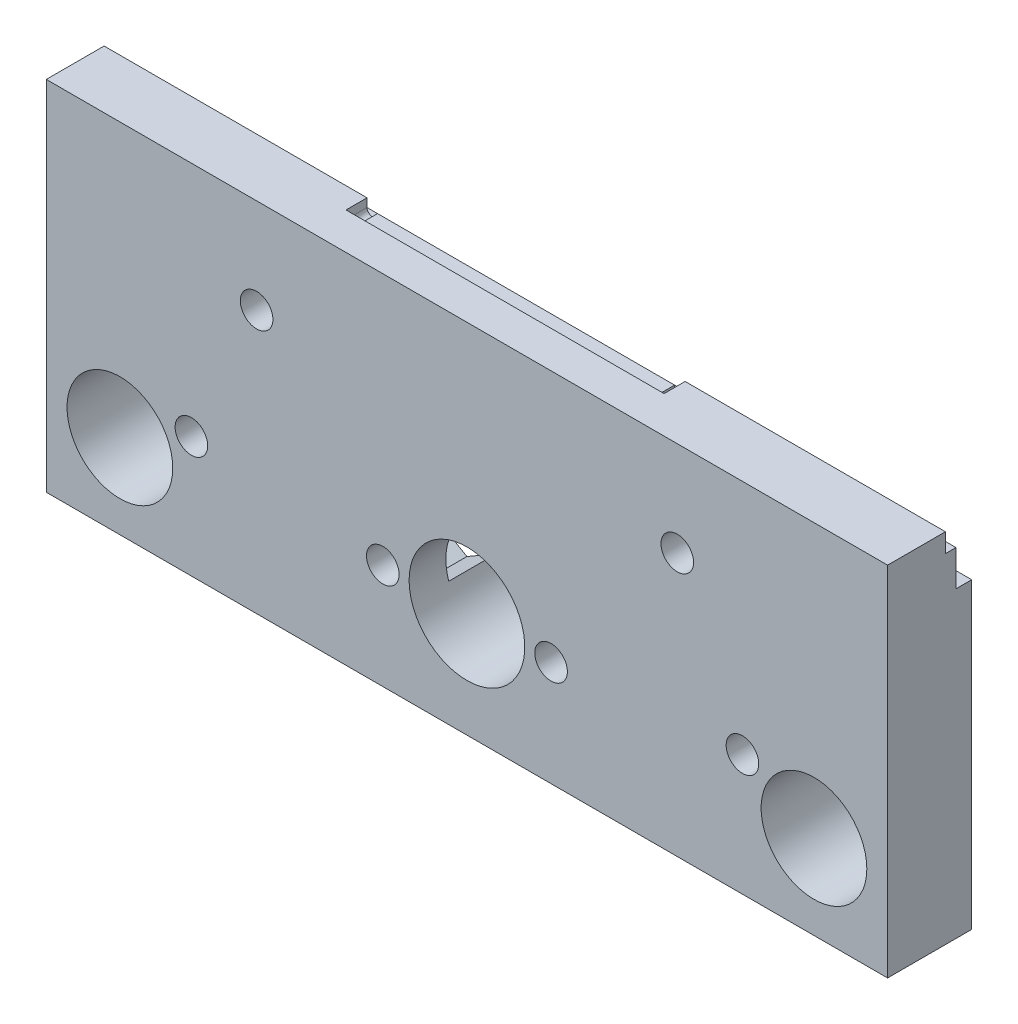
from build123d import *

# Parameters (mm, degrees)
SKETCH_2_W           = 80
SKETCH_2_H           = 34
SKETCH_2_R           = 5.025
SKETCH_2_R_2         = 4.05
EXTRUDE_1_DEPTH      = 8
CUT_EXTRUDE_2_DEPTH  = 88.292611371
SKETCH_5_R           = 1.55
CUT_EXTRUDE_3_DEPTH  = 88.292611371
CUT_EXTRUDE_5_DEPTH  = 4.5
SKETCH_11_R          = 1.55
CUT_EXTRUDE_7_DEPTH  = 88.292611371
CUT_EXTRUDE_11_DEPTH = 2
SKETCH_22_R          = 1.55
CUT_EXTRUDE_13_DEPTH = 88.292611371
SKETCH_20_R          = 5.5
CUT_EXTRUDE_14_DEPTH = 88.292611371


with BuildPart() as part:
    # Sketch 2 → Extrude 1 (new body)
    with BuildSketch(Plane.XY):
        with Locations((40, 17)):
            Rectangle(SKETCH_2_W, SKETCH_2_H)
        with Locations((7, 8)):
            Circle(SKETCH_2_R, mode=Mode.SUBTRACT)
        with Locations((40, 10)):
            Circle(SKETCH_2_R_2, mode=Mode.SUBTRACT)
        with Locations((73, 8)):
            Circle(SKETCH_2_R, mode=Mode.SUBTRACT)
    extrude(amount=EXTRUDE_1_DEPTH)

    # Sketch 4 → Cut-Extrude 2 (cut, through all)
    with BuildSketch(Plane(origin=(80, 0, 0), x_dir=(0, 0, -1), z_dir=(1, 0, 0))):
        Polygon((-1.5, 32.2), (-2.5, 32.2), (-2.5, 34), (0, 34), (0, 28.8), (-1.5, 28.8), align=None)
    extrude(amount=-CUT_EXTRUDE_2_DEPTH, mode=Mode.SUBTRACT)

    # Sketch 5 → Cut-Extrude 3 (cut, through all)
    with BuildSketch(Plane.XY.offset(8)):
        with Locations((48, 10)):
            Circle(SKETCH_5_R)
        with Locations((32, 10)):
            Circle(SKETCH_5_R)
    extrude(amount=-CUT_EXTRUDE_3_DEPTH, mode=Mode.SUBTRACT)

    # Sketch 8 → Cut-Extrude 5 (cut)
    with BuildSketch(Plane(origin=(0, 0, 0), x_dir=(-1, 0, 0), z_dir=(0, 0, -1))):
        Polygon((-45.15, 8.354551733), (-45.15, 11.645448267), (-48, 13.290896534), (-50.85, 11.645448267), (-50.85, 8.354551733), (-48, 6.709103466), align=None)
        Polygon((-34.85, 8.354551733), (-32, 6.709103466), (-29.15, 8.354551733), (-29.15, 11.645448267), (-32, 13.290896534), (-34.85, 11.645448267), align=None)
    extrude(amount=-CUT_EXTRUDE_5_DEPTH, mode=Mode.SUBTRACT)

    # Sketch 11 → Cut-Extrude 7 (cut, through all)
    with BuildSketch(Plane(origin=(0, 0, 0), x_dir=(-1, 0, 0), z_dir=(0, 0, -1))):
        with Locations((-60, 25)):
            Circle(SKETCH_11_R)
        with Locations((-20, 25)):
            Circle(SKETCH_11_R)
    extrude(amount=-CUT_EXTRUDE_7_DEPTH, mode=Mode.SUBTRACT)

    # Sketch 19 → Cut-Extrude 11 (cut)
    with BuildSketch(Plane(origin=(0, 0, 2.5), x_dir=(-1, 0, 0), z_dir=(0, 0, -1))):
        with BuildLine():
            Line((-25, 34), (-55.247938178, 34))
            Line((-55.247938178, 34), (-55.247938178, 33.2))
            ThreePointArc((-55.247938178, 33.2), (-54.747938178, 32.7), (-54.247938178, 33.2))
            Line((-54.247938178, 33.2), (-26, 33.2))
            ThreePointArc((-26, 33.2), (-25.5, 32.7), (-25, 33.2))
            Line((-25, 33.2), (-25, 34))
        make_face()
    extrude(amount=-CUT_EXTRUDE_11_DEPTH, mode=Mode.SUBTRACT)

    # Sketch 22 → Cut-Extrude 13 (cut, through all)
    with BuildSketch(Plane(origin=(0, 0, 0), x_dir=(-1, 0, 0), z_dir=(0, 0, -1))):
        with Locations((-66.2, 11.5)):
            Circle(SKETCH_22_R)
        with Locations(Location((-13.8, 11.5, 0), (0, 0, 180))):
            Circle(SKETCH_22_R)
    extrude(amount=-CUT_EXTRUDE_13_DEPTH, mode=Mode.SUBTRACT)

    # Sketch 20 → Cut-Extrude 14 (cut, through all)
    with BuildSketch(Plane(origin=(0, 0, 0), x_dir=(-1, 0, 0), z_dir=(0, 0, -1))):
        with Locations((-40, 10)):
            Circle(SKETCH_20_R)
    extrude(amount=-CUT_EXTRUDE_14_DEPTH, mode=Mode.SUBTRACT)


solid = part.part
